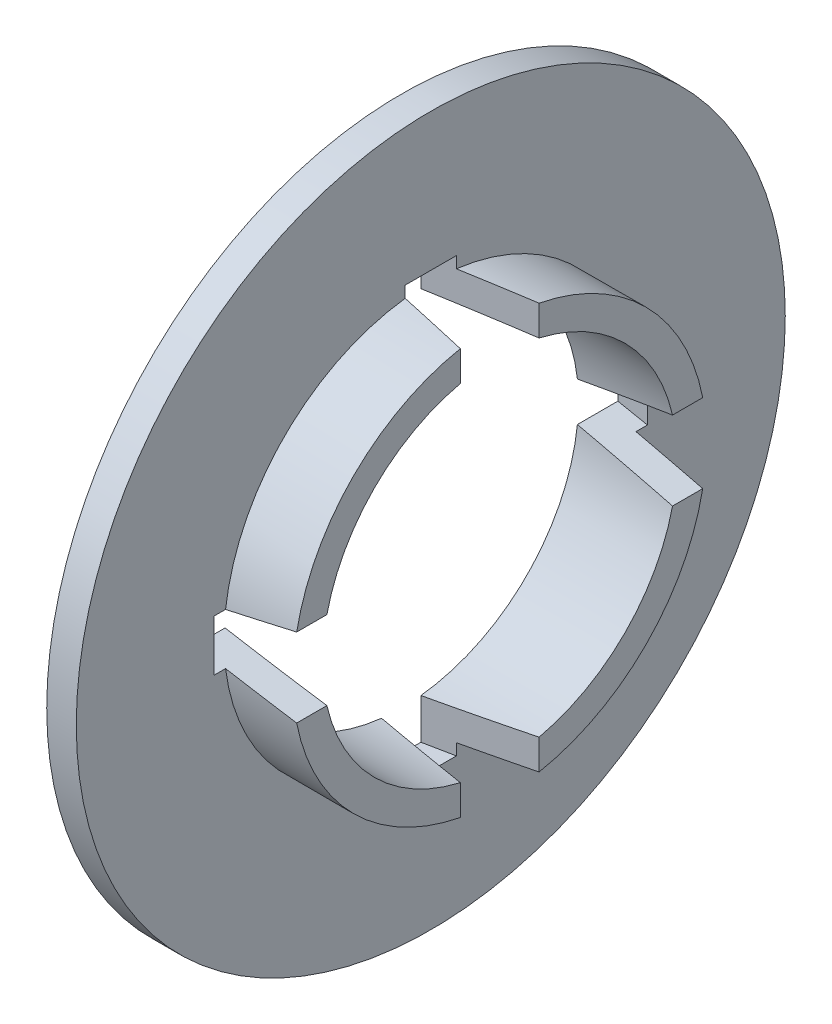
from build123d import *

# Parameters (mm, degrees)
ENL_V_MAT_EXTRU_2_DEPTH      = 4
R_P_TITION_CIRCULAIRE1_COUNT = 4


with BuildPart() as part:
    # Esquisse1 → R_volution1 (revolve)
    with BuildSketch(Plane.XY, mode=Mode.PRIVATE) as r_volution1_sk:
        Polygon((0, 18), (0, 9), (5, 9), (5, 10.5), (1.5, 10.5), (1.5, 18), align=None)
    revolve(r_volution1_sk.sketch.rotate(Axis((-80.299649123, 0, 0), (1, 0, 0)), 90), axis=Axis((-80.299649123, 0, 0), (1, 0, 0)))

    # Esquisse2 → Enl_v. mat.-Extru.2 (cut)
    with BuildSketch(Plane(origin=(0, 7, 0), x_dir=(-1, 0, 0), z_dir=(0, 1, 0))):
        Polygon((-5, -2), (-5, 2), (0, 1), (0, -1), align=None)
    enl_v_mat_extru_2 = extrude(amount=ENL_V_MAT_EXTRU_2_DEPTH, mode=Mode.SUBTRACT)

    # R_p_tition circulaire1: Enl_v. mat.-Extru.2 ×4 about axis
    r_p_tition_circulaire1_axis = Axis((0, 0, 0), (1, 0, 0))
    for i in range(1, R_P_TITION_CIRCULAIRE1_COUNT):
        add(enl_v_mat_extru_2.rotate(r_p_tition_circulaire1_axis, i * 360 / R_P_TITION_CIRCULAIRE1_COUNT), mode=Mode.SUBTRACT)


solid = part.part
